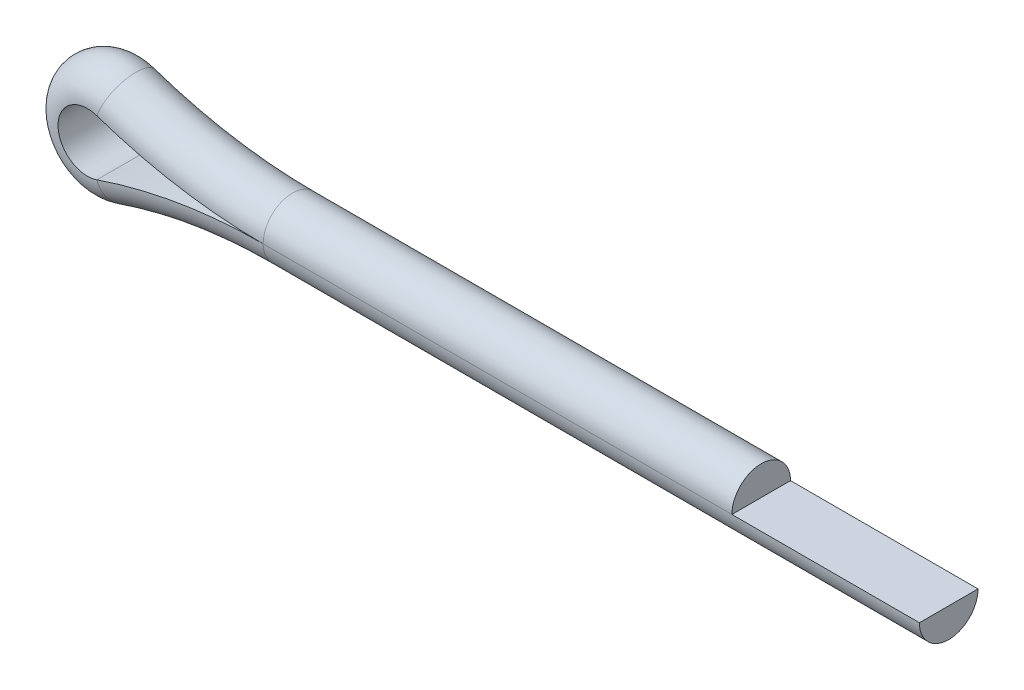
from build123d import *


with BuildPart() as part:
    # Body: sweep along a path in PathSke
    with BuildLine(Plane(origin=(1.207969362, 1.807969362, 0), x_dir=(0, 1, 0), z_dir=(0, 0, 1))) as body_path:
        Line((-1.557969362, -4.792030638), (-1.557969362, -0.792030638))
        ThreePointArc((-1.557969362, -0.792030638), (-1.501844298, -0.113884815), (-1.334996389, 0.5458072))
        ThreePointArc((-1.334996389, 0.5458072), (-1.807969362, 1.207969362), (-2.280942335, 0.5458072))
        ThreePointArc((-2.280942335, 0.5458072), (-2.114094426, -0.113884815), (-2.057969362, -0.792030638))
        Line((-2.057969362, -0.792030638), (-2.057969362, -6.392030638))
    # SectionSke → Body (sweep)
    with BuildSketch(Plane(origin=(6, 0.15, 0.15), x_dir=(0, 1, 0), z_dir=(1, 0, 0))):
        with BuildLine():
            Line((-0.15, -0.4), (-0.15, 0.1))
            ThreePointArc((-0.15, 0.1), (0.1, -0.15), (-0.15, -0.4))
        make_face()
    sweep(path=body_path.line)


solid = part.part
